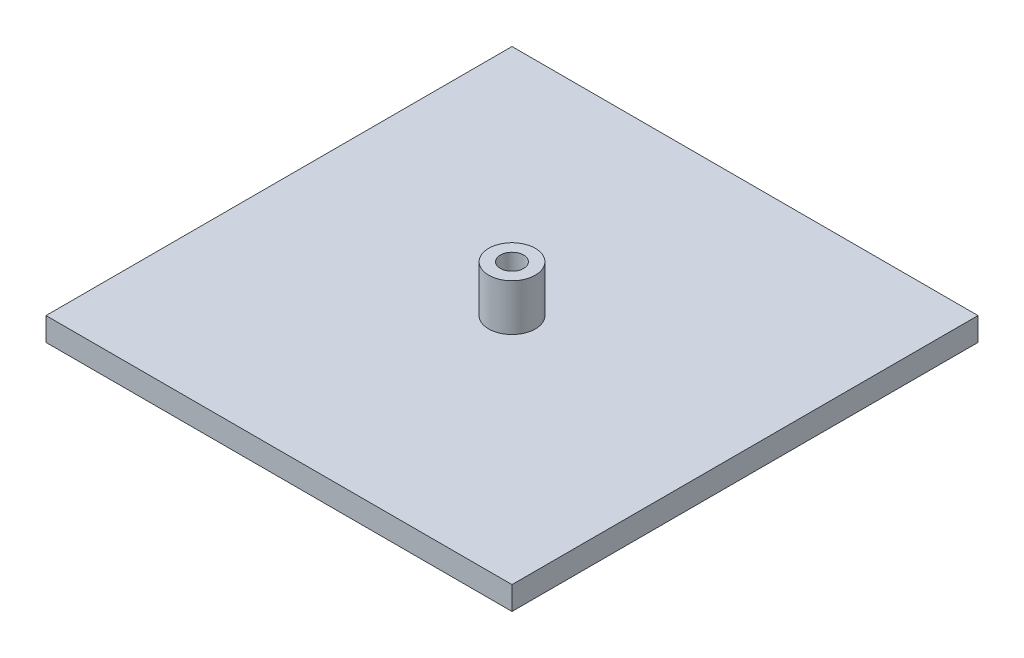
ISO-10303-21;
HEADER;
FILE_DESCRIPTION(('STEP AP214'),'2;1');
FILE_NAME('part.step','',(''),(''),'','','');
FILE_SCHEMA(('AUTOMOTIVE_DESIGN { 1 0 10303 214 1 1 1 1 }'));
ENDSEC;
DATA;
#1=APPLICATION_CONTEXT('core data for automotive mechanical design processes');
#2=APPLICATION_PROTOCOL_DEFINITION('international standard','automotive_design',2000,#1);
#3=PRODUCT_CONTEXT('',#1,'mechanical');
#4=PRODUCT('Part','Part','',(#3));
#5=PRODUCT_RELATED_PRODUCT_CATEGORY('part','',(#4));
#6=PRODUCT_DEFINITION_FORMATION('','',#4);
#7=PRODUCT_DEFINITION_CONTEXT('part definition',#1,'design');
#8=PRODUCT_DEFINITION('design','',#6,#7);
#9=PRODUCT_DEFINITION_SHAPE('','',#8);
#10=(LENGTH_UNIT() NAMED_UNIT(*) SI_UNIT(.MILLI.,.METRE.));
#11=(NAMED_UNIT(*) PLANE_ANGLE_UNIT() SI_UNIT($,.RADIAN.));
#12=(NAMED_UNIT(*) SI_UNIT($,.STERADIAN.) SOLID_ANGLE_UNIT());
#13=UNCERTAINTY_MEASURE_WITH_UNIT(LENGTH_MEASURE(1.E-05),#10,'distance_accuracy_value','');
#14=(GEOMETRIC_REPRESENTATION_CONTEXT(3) GLOBAL_UNCERTAINTY_ASSIGNED_CONTEXT((#13)) GLOBAL_UNIT_ASSIGNED_CONTEXT((#10,
#11,#12)) REPRESENTATION_CONTEXT('',''));
#15=CARTESIAN_POINT('',(0.,0.,0.));
#16=DIRECTION('',(0.,0.,1.));
#17=DIRECTION('',(1.,0.,0.));
#18=AXIS2_PLACEMENT_3D('',#15,#16,#17);
#19=CARTESIAN_POINT('',(10.,1.,-10.));
#20=DIRECTION('',(0.,-1.,0.));
#21=DIRECTION('',(0.,0.,-1.));
#22=AXIS2_PLACEMENT_3D('',#19,#20,#21);
#23=PLANE('',#22);
#24=DIRECTION('',(0.,0.,-1.));
#25=VECTOR('',#24,1.);
#26=CARTESIAN_POINT('',(10.,1.,10.));
#27=LINE('',#26,#25);
#28=CARTESIAN_POINT('',(10.,1.,10.));
#29=VERTEX_POINT('',#28);
#30=CARTESIAN_POINT('',(10.,1.,-10.));
#31=VERTEX_POINT('',#30);
#32=EDGE_CURVE('E85',#29,#31,#27,.T.);
#33=ORIENTED_EDGE('',*,*,#32,.T.);
#34=DIRECTION('',(-1.,0.,0.));
#35=VECTOR('',#34,1.);
#36=CARTESIAN_POINT('',(-9.99999999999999,1.,-10.));
#37=LINE('',#36,#35);
#38=CARTESIAN_POINT('',(-9.99999999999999,1.,-10.));
#39=VERTEX_POINT('',#38);
#40=EDGE_CURVE('E80',#31,#39,#37,.T.);
#41=ORIENTED_EDGE('',*,*,#40,.T.);
#42=DIRECTION('',(0.,0.,1.));
#43=VECTOR('',#42,1.);
#44=CARTESIAN_POINT('',(-9.99999999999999,1.,10.));
#45=LINE('',#44,#43);
#46=CARTESIAN_POINT('',(-9.99999999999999,1.,10.));
#47=VERTEX_POINT('',#46);
#48=EDGE_CURVE('E83',#39,#47,#45,.T.);
#49=ORIENTED_EDGE('',*,*,#48,.T.);
#50=DIRECTION('',(1.,0.,0.));
#51=VECTOR('',#50,1.);
#52=CARTESIAN_POINT('',(-9.99999999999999,1.,10.));
#53=LINE('',#52,#51);
#54=EDGE_CURVE('E49',#47,#29,#53,.T.);
#55=ORIENTED_EDGE('',*,*,#54,.T.);
#56=EDGE_LOOP('',(#33,#41,#49,#55));
#57=FACE_BOUND('',#56,.T.);
#58=CARTESIAN_POINT('',(0.,1.,0.));
#59=DIRECTION('',(0.,-1.,0.));
#60=DIRECTION('',(0.,0.,-1.));
#61=AXIS2_PLACEMENT_3D('',#58,#59,#60);
#62=CIRCLE('',#61,1.);
#63=CARTESIAN_POINT('',(0.,1.,-1.));
#64=VERTEX_POINT('',#63);
#65=EDGE_CURVE('E11',#64,#64,#62,.F.);
#66=ORIENTED_EDGE('',*,*,#65,.F.);
#67=EDGE_LOOP('',(#66));
#68=FACE_BOUND('',#67,.T.);
#69=ADVANCED_FACE('F32',(#57,#68),#23,.F.);
#70=CARTESIAN_POINT('',(10.,0.,-10.));
#71=DIRECTION('',(0.,-1.,0.));
#72=DIRECTION('',(0.,0.,-1.));
#73=AXIS2_PLACEMENT_3D('',#70,#71,#72);
#74=PLANE('',#73);
#75=DIRECTION('',(0.,0.,-1.));
#76=VECTOR('',#75,1.);
#77=CARTESIAN_POINT('',(10.,0.,10.));
#78=LINE('',#77,#76);
#79=CARTESIAN_POINT('',(10.,0.,10.));
#80=VERTEX_POINT('',#79);
#81=CARTESIAN_POINT('',(10.,0.,-10.));
#82=VERTEX_POINT('',#81);
#83=EDGE_CURVE('E99',#80,#82,#78,.T.);
#84=ORIENTED_EDGE('',*,*,#83,.F.);
#85=DIRECTION('',(1.,0.,0.));
#86=VECTOR('',#85,1.);
#87=CARTESIAN_POINT('',(-9.99999999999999,0.,10.));
#88=LINE('',#87,#86);
#89=CARTESIAN_POINT('',(-9.99999999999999,0.,10.));
#90=VERTEX_POINT('',#89);
#91=EDGE_CURVE('E72',#90,#80,#88,.T.);
#92=ORIENTED_EDGE('',*,*,#91,.F.);
#93=DIRECTION('',(0.,0.,1.));
#94=VECTOR('',#93,1.);
#95=CARTESIAN_POINT('',(-9.99999999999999,0.,10.));
#96=LINE('',#95,#94);
#97=CARTESIAN_POINT('',(-9.99999999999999,0.,-10.));
#98=VERTEX_POINT('',#97);
#99=EDGE_CURVE('E66',#98,#90,#96,.T.);
#100=ORIENTED_EDGE('',*,*,#99,.F.);
#101=DIRECTION('',(-1.,0.,0.));
#102=VECTOR('',#101,1.);
#103=CARTESIAN_POINT('',(-9.99999999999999,0.,-10.));
#104=LINE('',#103,#102);
#105=EDGE_CURVE('E90',#82,#98,#104,.T.);
#106=ORIENTED_EDGE('',*,*,#105,.F.);
#107=EDGE_LOOP('',(#84,#92,#100,#106));
#108=FACE_BOUND('',#107,.T.);
#109=CARTESIAN_POINT('',(0.,0.,0.));
#110=DIRECTION('',(0.,1.,0.));
#111=DIRECTION('',(0.,0.,1.));
#112=AXIS2_PLACEMENT_3D('',#109,#110,#111);
#113=CIRCLE('',#112,0.5);
#114=CARTESIAN_POINT('',(0.,0.,0.500000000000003));
#115=VERTEX_POINT('',#114);
#116=EDGE_CURVE('E102',#115,#115,#113,.T.);
#117=ORIENTED_EDGE('',*,*,#116,.T.);
#118=EDGE_LOOP('',(#117));
#119=FACE_BOUND('',#118,.T.);
#120=ADVANCED_FACE('F110',(#108,#119),#74,.T.);
#121=CARTESIAN_POINT('',(10.,1.,10.));
#122=DIRECTION('',(-1.,0.,0.));
#123=DIRECTION('',(0.,0.,1.));
#124=AXIS2_PLACEMENT_3D('',#121,#122,#123);
#125=PLANE('',#124);
#126=ORIENTED_EDGE('',*,*,#83,.T.);
#127=DIRECTION('',(0.,-1.,0.));
#128=VECTOR('',#127,1.);
#129=CARTESIAN_POINT('',(10.,1.,-10.));
#130=LINE('',#129,#128);
#131=EDGE_CURVE('E41',#31,#82,#130,.T.);
#132=ORIENTED_EDGE('',*,*,#131,.F.);
#133=ORIENTED_EDGE('',*,*,#32,.F.);
#134=DIRECTION('',(0.,-1.,0.));
#135=VECTOR('',#134,1.);
#136=CARTESIAN_POINT('',(10.,1.,10.));
#137=LINE('',#136,#135);
#138=EDGE_CURVE('E95',#29,#80,#137,.T.);
#139=ORIENTED_EDGE('',*,*,#138,.T.);
#140=EDGE_LOOP('',(#126,#132,#133,#139));
#141=FACE_BOUND('',#140,.T.);
#142=ADVANCED_FACE('F34',(#141),#125,.F.);
#143=CARTESIAN_POINT('',(-9.99999999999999,1.,-10.));
#144=DIRECTION('',(0.,0.,1.));
#145=DIRECTION('',(1.,0.,0.));
#146=AXIS2_PLACEMENT_3D('',#143,#144,#145);
#147=PLANE('',#146);
#148=ORIENTED_EDGE('',*,*,#105,.T.);
#149=DIRECTION('',(0.,-1.,0.));
#150=VECTOR('',#149,1.);
#151=CARTESIAN_POINT('',(-9.99999999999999,1.,-10.));
#152=LINE('',#151,#150);
#153=EDGE_CURVE('E88',#39,#98,#152,.T.);
#154=ORIENTED_EDGE('',*,*,#153,.F.);
#155=ORIENTED_EDGE('',*,*,#40,.F.);
#156=ORIENTED_EDGE('',*,*,#131,.T.);
#157=EDGE_LOOP('',(#148,#154,#155,#156));
#158=FACE_BOUND('',#157,.T.);
#159=ADVANCED_FACE('F89',(#158),#147,.F.);
#160=CARTESIAN_POINT('',(-9.99999999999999,1.,10.));
#161=DIRECTION('',(1.,0.,0.));
#162=DIRECTION('',(0.,0.,-1.));
#163=AXIS2_PLACEMENT_3D('',#160,#161,#162);
#164=PLANE('',#163);
#165=ORIENTED_EDGE('',*,*,#99,.T.);
#166=DIRECTION('',(0.,-1.,0.));
#167=VECTOR('',#166,1.);
#168=CARTESIAN_POINT('',(-9.99999999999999,1.,10.));
#169=LINE('',#168,#167);
#170=EDGE_CURVE('E91',#47,#90,#169,.T.);
#171=ORIENTED_EDGE('',*,*,#170,.F.);
#172=ORIENTED_EDGE('',*,*,#48,.F.);
#173=ORIENTED_EDGE('',*,*,#153,.T.);
#174=EDGE_LOOP('',(#165,#171,#172,#173));
#175=FACE_BOUND('',#174,.T.);
#176=ADVANCED_FACE('F93',(#175),#164,.F.);
#177=CARTESIAN_POINT('',(-9.99999999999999,1.,10.));
#178=DIRECTION('',(0.,0.,-1.));
#179=DIRECTION('',(-1.,0.,0.));
#180=AXIS2_PLACEMENT_3D('',#177,#178,#179);
#181=PLANE('',#180);
#182=ORIENTED_EDGE('',*,*,#91,.T.);
#183=ORIENTED_EDGE('',*,*,#138,.F.);
#184=ORIENTED_EDGE('',*,*,#54,.F.);
#185=ORIENTED_EDGE('',*,*,#170,.T.);
#186=EDGE_LOOP('',(#182,#183,#184,#185));
#187=FACE_BOUND('',#186,.T.);
#188=ADVANCED_FACE('F139',(#187),#181,.F.);
#189=CARTESIAN_POINT('',(0.,1.,0.));
#190=DIRECTION('',(0.,-1.,0.));
#191=DIRECTION('',(0.,0.,-1.));
#192=AXIS2_PLACEMENT_3D('',#189,#190,#191);
#193=CYLINDRICAL_SURFACE('',#192,0.5);
#194=ORIENTED_EDGE('',*,*,#116,.F.);
#195=EDGE_LOOP('',(#194));
#196=FACE_BOUND('',#195,.T.);
#197=CARTESIAN_POINT('',(0.,3.,0.));
#198=DIRECTION('',(0.,1.,0.));
#199=DIRECTION('',(0.,0.,1.));
#200=AXIS2_PLACEMENT_3D('',#197,#198,#199);
#201=CIRCLE('',#200,0.500000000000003);
#202=CARTESIAN_POINT('',(0.,3.,0.500000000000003));
#203=VERTEX_POINT('',#202);
#204=EDGE_CURVE('E120',#203,#203,#201,.T.);
#205=ORIENTED_EDGE('',*,*,#204,.T.);
#206=EDGE_LOOP('',(#205));
#207=FACE_BOUND('',#206,.T.);
#208=ADVANCED_FACE('F126',(#196,#207),#193,.F.);
#209=CARTESIAN_POINT('',(0.,3.,0.));
#210=DIRECTION('',(0.,1.,0.));
#211=DIRECTION('',(0.,0.,1.));
#212=AXIS2_PLACEMENT_3D('',#209,#210,#211);
#213=PLANE('',#212);
#214=CARTESIAN_POINT('',(0.,3.,0.));
#215=DIRECTION('',(0.,1.,0.));
#216=DIRECTION('',(0.,0.,1.));
#217=AXIS2_PLACEMENT_3D('',#214,#215,#216);
#218=CIRCLE('',#217,1.);
#219=CARTESIAN_POINT('',(0.,3.,1.));
#220=VERTEX_POINT('',#219);
#221=EDGE_CURVE('E117',#220,#220,#218,.T.);
#222=ORIENTED_EDGE('',*,*,#221,.T.);
#223=EDGE_LOOP('',(#222));
#224=FACE_BOUND('',#223,.T.);
#225=ORIENTED_EDGE('',*,*,#204,.F.);
#226=EDGE_LOOP('',(#225));
#227=FACE_BOUND('',#226,.T.);
#228=ADVANCED_FACE('F128',(#224,#227),#213,.T.);
#229=CARTESIAN_POINT('',(0.,3.,0.));
#230=DIRECTION('',(0.,-1.,0.));
#231=DIRECTION('',(0.,0.,-1.));
#232=AXIS2_PLACEMENT_3D('',#229,#230,#231);
#233=CYLINDRICAL_SURFACE('',#232,1.);
#234=ORIENTED_EDGE('',*,*,#221,.F.);
#235=EDGE_LOOP('',(#234));
#236=FACE_BOUND('',#235,.T.);
#237=ORIENTED_EDGE('',*,*,#65,.T.);
#238=EDGE_LOOP('',(#237));
#239=FACE_BOUND('',#238,.T.);
#240=ADVANCED_FACE('F130',(#236,#239),#233,.T.);
#241=CLOSED_SHELL('',(#69,#120,#142,#159,#176,#188,#208,#228,#240));
#242=MANIFOLD_SOLID_BREP('B2',#241);
#243=ADVANCED_BREP_SHAPE_REPRESENTATION('',(#18,#242),#14);
#244=SHAPE_DEFINITION_REPRESENTATION(#9,#243);
ENDSEC;
END-ISO-10303-21;
